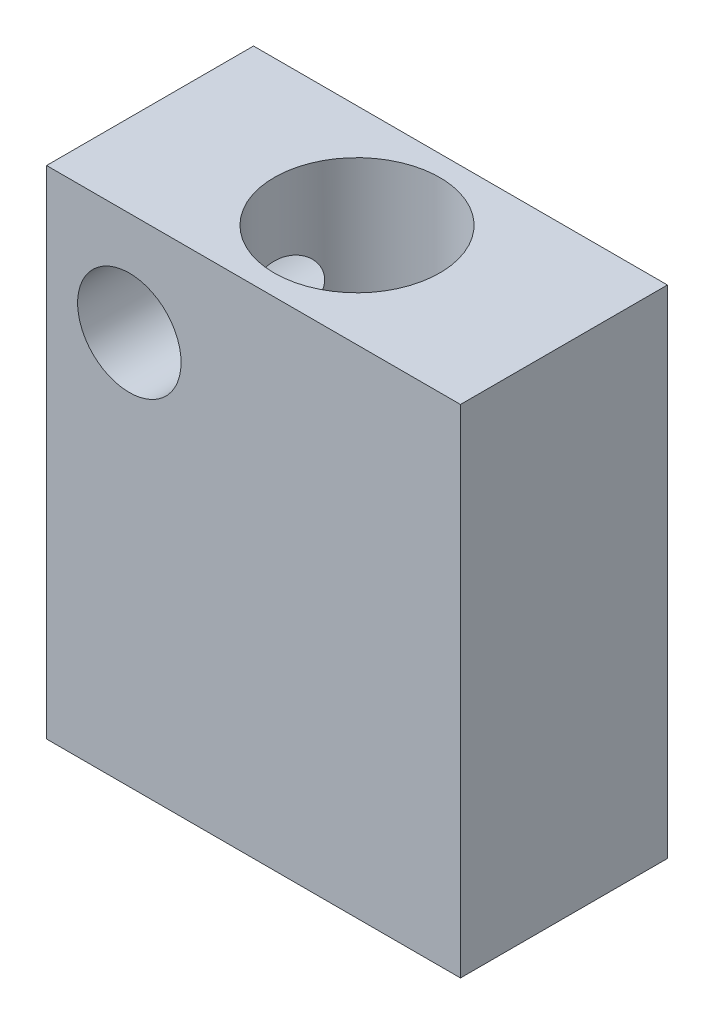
ISO-10303-21;
HEADER;
FILE_DESCRIPTION(('STEP AP214'),'2;1');
FILE_NAME('part.step','',(''),(''),'','','');
FILE_SCHEMA(('AUTOMOTIVE_DESIGN { 1 0 10303 214 1 1 1 1 }'));
ENDSEC;
DATA;
#1=APPLICATION_CONTEXT('core data for automotive mechanical design processes');
#2=APPLICATION_PROTOCOL_DEFINITION('international standard','automotive_design',2000,#1);
#3=PRODUCT_CONTEXT('',#1,'mechanical');
#4=PRODUCT('Part','Part','',(#3));
#5=PRODUCT_RELATED_PRODUCT_CATEGORY('part','',(#4));
#6=PRODUCT_DEFINITION_FORMATION('','',#4);
#7=PRODUCT_DEFINITION_CONTEXT('part definition',#1,'design');
#8=PRODUCT_DEFINITION('design','',#6,#7);
#9=PRODUCT_DEFINITION_SHAPE('','',#8);
#10=(LENGTH_UNIT() NAMED_UNIT(*) SI_UNIT(.MILLI.,.METRE.));
#11=(NAMED_UNIT(*) PLANE_ANGLE_UNIT() SI_UNIT($,.RADIAN.));
#12=(NAMED_UNIT(*) SI_UNIT($,.STERADIAN.) SOLID_ANGLE_UNIT());
#13=UNCERTAINTY_MEASURE_WITH_UNIT(LENGTH_MEASURE(1.E-05),#10,'distance_accuracy_value','');
#14=(GEOMETRIC_REPRESENTATION_CONTEXT(3) GLOBAL_UNCERTAINTY_ASSIGNED_CONTEXT((#13)) GLOBAL_UNIT_ASSIGNED_CONTEXT((#10,
#11,#12)) REPRESENTATION_CONTEXT('',''));
#15=CARTESIAN_POINT('',(0.,0.,0.));
#16=DIRECTION('',(0.,0.,1.));
#17=DIRECTION('',(1.,0.,0.));
#18=AXIS2_PLACEMENT_3D('',#15,#16,#17);
#19=CARTESIAN_POINT('',(50.,-120.,25.));
#20=DIRECTION('',(1.,0.,0.));
#21=DIRECTION('',(0.,0.,-1.));
#22=AXIS2_PLACEMENT_3D('',#19,#20,#21);
#23=PLANE('',#22);
#24=DIRECTION('',(0.,0.,-1.));
#25=VECTOR('',#24,1.);
#26=CARTESIAN_POINT('',(50.,0.,25.));
#27=LINE('',#26,#25);
#28=CARTESIAN_POINT('',(50.,0.,25.));
#29=VERTEX_POINT('',#28);
#30=CARTESIAN_POINT('',(50.,0.,-25.));
#31=VERTEX_POINT('',#30);
#32=EDGE_CURVE('E104',#29,#31,#27,.T.);
#33=ORIENTED_EDGE('',*,*,#32,.F.);
#34=DIRECTION('',(0.,1.,0.));
#35=VECTOR('',#34,1.);
#36=CARTESIAN_POINT('',(50.,-120.,25.));
#37=LINE('',#36,#35);
#38=CARTESIAN_POINT('',(50.,-120.,25.));
#39=VERTEX_POINT('',#38);
#40=EDGE_CURVE('E11',#39,#29,#37,.T.);
#41=ORIENTED_EDGE('',*,*,#40,.F.);
#42=DIRECTION('',(0.,0.,-1.));
#43=VECTOR('',#42,1.);
#44=CARTESIAN_POINT('',(50.,-120.,25.));
#45=LINE('',#44,#43);
#46=CARTESIAN_POINT('',(50.,-120.,-25.));
#47=VERTEX_POINT('',#46);
#48=EDGE_CURVE('E97',#39,#47,#45,.T.);
#49=ORIENTED_EDGE('',*,*,#48,.T.);
#50=DIRECTION('',(0.,1.,0.));
#51=VECTOR('',#50,1.);
#52=CARTESIAN_POINT('',(50.,-120.,-25.));
#53=LINE('',#52,#51);
#54=EDGE_CURVE('E80',#47,#31,#53,.T.);
#55=ORIENTED_EDGE('',*,*,#54,.T.);
#56=EDGE_LOOP('',(#33,#41,#49,#55));
#57=FACE_BOUND('',#56,.T.);
#58=ADVANCED_FACE('F33',(#57),#23,.T.);
#59=CARTESIAN_POINT('',(-50.,-120.,25.));
#60=DIRECTION('',(0.,0.,1.));
#61=DIRECTION('',(1.,0.,0.));
#62=AXIS2_PLACEMENT_3D('',#59,#60,#61);
#63=PLANE('',#62);
#64=CARTESIAN_POINT('',(-30.,-25.,25.));
#65=DIRECTION('',(0.,0.,1.));
#66=DIRECTION('',(1.,0.,0.));
#67=AXIS2_PLACEMENT_3D('',#64,#65,#66);
#68=CIRCLE('',#67,12.5);
#69=CARTESIAN_POINT('',(-17.5,-25.,25.));
#70=VERTEX_POINT('',#69);
#71=EDGE_CURVE('E137',#70,#70,#68,.T.);
#72=ORIENTED_EDGE('',*,*,#71,.F.);
#73=EDGE_LOOP('',(#72));
#74=FACE_BOUND('',#73,.T.);
#75=DIRECTION('',(1.,0.,0.));
#76=VECTOR('',#75,1.);
#77=CARTESIAN_POINT('',(-50.,0.,25.));
#78=LINE('',#77,#76);
#79=CARTESIAN_POINT('',(-50.,0.,25.));
#80=VERTEX_POINT('',#79);
#81=EDGE_CURVE('E99',#80,#29,#78,.T.);
#82=ORIENTED_EDGE('',*,*,#81,.F.);
#83=DIRECTION('',(0.,1.,0.));
#84=VECTOR('',#83,1.);
#85=CARTESIAN_POINT('',(-50.,-120.,25.));
#86=LINE('',#85,#84);
#87=CARTESIAN_POINT('',(-50.,-120.,25.));
#88=VERTEX_POINT('',#87);
#89=EDGE_CURVE('E46',#88,#80,#86,.T.);
#90=ORIENTED_EDGE('',*,*,#89,.F.);
#91=DIRECTION('',(1.,0.,0.));
#92=VECTOR('',#91,1.);
#93=CARTESIAN_POINT('',(-50.,-120.,25.));
#94=LINE('',#93,#92);
#95=EDGE_CURVE('E94',#88,#39,#94,.T.);
#96=ORIENTED_EDGE('',*,*,#95,.T.);
#97=ORIENTED_EDGE('',*,*,#40,.T.);
#98=EDGE_LOOP('',(#82,#90,#96,#97));
#99=FACE_BOUND('',#98,.T.);
#100=ADVANCED_FACE('F115',(#74,#99),#63,.T.);
#101=CARTESIAN_POINT('',(-50.,-120.,25.));
#102=DIRECTION('',(-1.,0.,0.));
#103=DIRECTION('',(0.,0.,1.));
#104=AXIS2_PLACEMENT_3D('',#101,#102,#103);
#105=PLANE('',#104);
#106=DIRECTION('',(0.,0.,1.));
#107=VECTOR('',#106,1.);
#108=CARTESIAN_POINT('',(-50.,0.,25.));
#109=LINE('',#108,#107);
#110=CARTESIAN_POINT('',(-50.,0.,-25.));
#111=VERTEX_POINT('',#110);
#112=EDGE_CURVE('E88',#111,#80,#109,.T.);
#113=ORIENTED_EDGE('',*,*,#112,.F.);
#114=DIRECTION('',(0.,1.,0.));
#115=VECTOR('',#114,1.);
#116=CARTESIAN_POINT('',(-50.,-120.,-25.));
#117=LINE('',#116,#115);
#118=CARTESIAN_POINT('',(-50.,-120.,-25.));
#119=VERTEX_POINT('',#118);
#120=EDGE_CURVE('E83',#119,#111,#117,.T.);
#121=ORIENTED_EDGE('',*,*,#120,.F.);
#122=DIRECTION('',(0.,0.,1.));
#123=VECTOR('',#122,1.);
#124=CARTESIAN_POINT('',(-50.,-120.,25.));
#125=LINE('',#124,#123);
#126=EDGE_CURVE('E86',#119,#88,#125,.T.);
#127=ORIENTED_EDGE('',*,*,#126,.T.);
#128=ORIENTED_EDGE('',*,*,#89,.T.);
#129=EDGE_LOOP('',(#113,#121,#127,#128));
#130=FACE_BOUND('',#129,.T.);
#131=ADVANCED_FACE('F85',(#130),#105,.T.);
#132=CARTESIAN_POINT('',(-50.,-120.,-25.));
#133=DIRECTION('',(0.,0.,-1.));
#134=DIRECTION('',(-1.,0.,0.));
#135=AXIS2_PLACEMENT_3D('',#132,#133,#134);
#136=PLANE('',#135);
#137=CARTESIAN_POINT('',(-30.,-25.,-25.));
#138=DIRECTION('',(0.,0.,1.));
#139=DIRECTION('',(1.,0.,0.));
#140=AXIS2_PLACEMENT_3D('',#137,#138,#139);
#141=CIRCLE('',#140,12.5);
#142=CARTESIAN_POINT('',(-17.5,-25.,-25.));
#143=VERTEX_POINT('',#142);
#144=EDGE_CURVE('E135',#143,#143,#141,.T.);
#145=ORIENTED_EDGE('',*,*,#144,.T.);
#146=EDGE_LOOP('',(#145));
#147=FACE_BOUND('',#146,.T.);
#148=DIRECTION('',(-1.,0.,0.));
#149=VECTOR('',#148,1.);
#150=CARTESIAN_POINT('',(-50.,0.,-25.));
#151=LINE('',#150,#149);
#152=EDGE_CURVE('E107',#31,#111,#151,.T.);
#153=ORIENTED_EDGE('',*,*,#152,.F.);
#154=ORIENTED_EDGE('',*,*,#54,.F.);
#155=DIRECTION('',(-1.,0.,0.));
#156=VECTOR('',#155,1.);
#157=CARTESIAN_POINT('',(-50.,-120.,-25.));
#158=LINE('',#157,#156);
#159=EDGE_CURVE('E93',#47,#119,#158,.T.);
#160=ORIENTED_EDGE('',*,*,#159,.T.);
#161=ORIENTED_EDGE('',*,*,#120,.T.);
#162=EDGE_LOOP('',(#153,#154,#160,#161));
#163=FACE_BOUND('',#162,.T.);
#164=ADVANCED_FACE('F96',(#147,#163),#136,.T.);
#165=CARTESIAN_POINT('',(0.,-120.,0.));
#166=DIRECTION('',(0.,-1.,0.));
#167=DIRECTION('',(0.,0.,-1.));
#168=AXIS2_PLACEMENT_3D('',#165,#166,#167);
#169=PLANE('',#168);
#170=CARTESIAN_POINT('',(0.,-120.,0.));
#171=DIRECTION('',(0.,1.,0.));
#172=DIRECTION('',(0.,0.,1.));
#173=AXIS2_PLACEMENT_3D('',#170,#171,#172);
#174=CIRCLE('',#173,20.);
#175=CARTESIAN_POINT('',(0.,-120.,20.));
#176=VERTEX_POINT('',#175);
#177=EDGE_CURVE('E108',#176,#176,#174,.T.);
#178=ORIENTED_EDGE('',*,*,#177,.T.);
#179=EDGE_LOOP('',(#178));
#180=FACE_BOUND('',#179,.T.);
#181=ORIENTED_EDGE('',*,*,#48,.F.);
#182=ORIENTED_EDGE('',*,*,#95,.F.);
#183=ORIENTED_EDGE('',*,*,#126,.F.);
#184=ORIENTED_EDGE('',*,*,#159,.F.);
#185=EDGE_LOOP('',(#181,#182,#183,#184));
#186=FACE_BOUND('',#185,.T.);
#187=ADVANCED_FACE('F92',(#180,#186),#169,.T.);
#188=CARTESIAN_POINT('',(0.,0.,0.));
#189=DIRECTION('',(0.,-1.,0.));
#190=DIRECTION('',(0.,0.,-1.));
#191=AXIS2_PLACEMENT_3D('',#188,#189,#190);
#192=PLANE('',#191);
#193=CARTESIAN_POINT('',(0.,0.,0.));
#194=DIRECTION('',(0.,1.,0.));
#195=DIRECTION('',(0.,0.,1.));
#196=AXIS2_PLACEMENT_3D('',#193,#194,#195);
#197=CIRCLE('',#196,20.);
#198=CARTESIAN_POINT('',(0.,0.,20.));
#199=VERTEX_POINT('',#198);
#200=EDGE_CURVE('E140',#199,#199,#197,.T.);
#201=ORIENTED_EDGE('',*,*,#200,.F.);
#202=EDGE_LOOP('',(#201));
#203=FACE_BOUND('',#202,.T.);
#204=ORIENTED_EDGE('',*,*,#32,.T.);
#205=ORIENTED_EDGE('',*,*,#152,.T.);
#206=ORIENTED_EDGE('',*,*,#112,.T.);
#207=ORIENTED_EDGE('',*,*,#81,.T.);
#208=EDGE_LOOP('',(#204,#205,#206,#207));
#209=FACE_BOUND('',#208,.T.);
#210=ADVANCED_FACE('F114',(#203,#209),#192,.F.);
#211=CARTESIAN_POINT('',(0.,-120.,0.));
#212=DIRECTION('',(0.,1.,0.));
#213=DIRECTION('',(0.,0.,1.));
#214=AXIS2_PLACEMENT_3D('',#211,#212,#213);
#215=CYLINDRICAL_SURFACE('',#214,20.);
#216=CARTESIAN_POINT('',(-17.5,-25.,-9.68245836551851));
#217=CARTESIAN_POINT('',(-17.5000016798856,-25.1959856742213,-9.68245689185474));
#218=CARTESIAN_POINT('',(-17.5046241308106,-25.3920604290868,-9.6741152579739));
#219=CARTESIAN_POINT('',(-17.5229816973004,-25.7824732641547,-9.64082274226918));
#220=CARTESIAN_POINT('',(-17.5367241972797,-25.9768098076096,-9.6158584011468));
#221=CARTESIAN_POINT('',(-17.5729548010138,-26.3624038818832,-9.54948638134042));
#222=CARTESIAN_POINT('',(-17.5954676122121,-26.5536511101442,-9.50803224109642));
#223=CARTESIAN_POINT('',(-17.6485462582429,-26.9307643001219,-9.40914213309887));
#224=CARTESIAN_POINT('',(-17.6791104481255,-27.1166313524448,-9.35170942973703));
#225=CARTESIAN_POINT('',(-17.7472127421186,-27.4805861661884,-9.22181003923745));
#226=CARTESIAN_POINT('',(-17.7847140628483,-27.6587091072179,-9.14942242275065));
#227=CARTESIAN_POINT('',(-17.8657373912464,-28.0069316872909,-8.99018372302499));
#228=CARTESIAN_POINT('',(-17.9092597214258,-28.1770308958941,-8.90333186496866));
#229=CARTESIAN_POINT('',(-18.0011179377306,-28.5080342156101,-8.71611127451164));
#230=CARTESIAN_POINT('',(-18.0494495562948,-28.668946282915,-8.61575449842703));
#231=CARTESIAN_POINT('',(-18.1497469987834,-28.9810050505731,-8.40241722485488));
#232=CARTESIAN_POINT('',(-18.2017142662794,-29.1321478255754,-8.28943170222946));
#233=CARTESIAN_POINT('',(-18.3577941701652,-29.5606287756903,-7.9406917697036));
#234=CARTESIAN_POINT('',(-18.4652498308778,-29.8238900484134,-7.68888746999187));
#235=CARTESIAN_POINT('',(-18.6807523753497,-30.309953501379,-7.14939140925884));
#236=CARTESIAN_POINT('',(-18.7887994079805,-30.5327449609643,-6.86169017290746));
#237=CARTESIAN_POINT('',(-18.9553640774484,-30.8552592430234,-6.38199084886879));
#238=CARTESIAN_POINT('',(-19.0159914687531,-30.9679361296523,-6.19924111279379));
#239=CARTESIAN_POINT('',(-19.1339053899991,-31.180026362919,-5.82512455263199));
#240=CARTESIAN_POINT('',(-19.1911916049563,-31.2794384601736,-5.63375691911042));
#241=CARTESIAN_POINT('',(-19.3014448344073,-31.4654943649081,-5.24360213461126));
#242=CARTESIAN_POINT('',(-19.3544094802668,-31.5521311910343,-5.04481100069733));
#243=CARTESIAN_POINT('',(-19.4551827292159,-31.7131097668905,-4.64103189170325));
#244=CARTESIAN_POINT('',(-19.5029907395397,-31.7874501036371,-4.43604320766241));
#245=CARTESIAN_POINT('',(-19.6022839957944,-31.9388299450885,-3.97701173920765));
#246=CARTESIAN_POINT('',(-19.6524086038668,-32.0131152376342,-3.72176319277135));
#247=CARTESIAN_POINT('',(-19.7432058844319,-32.1452496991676,-3.20539777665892));
#248=CARTESIAN_POINT('',(-19.783877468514,-32.203096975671,-2.94428023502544));
#249=CARTESIAN_POINT('',(-19.8551256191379,-32.303101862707,-2.41756965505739));
#250=CARTESIAN_POINT('',(-19.8856971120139,-32.3452515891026,-2.15197443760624));
#251=CARTESIAN_POINT('',(-19.9362643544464,-32.4143812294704,-1.61782462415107));
#252=CARTESIAN_POINT('',(-19.9562595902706,-32.4413604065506,-1.34926988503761));
#253=CARTESIAN_POINT('',(-19.9879736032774,-32.4839954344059,-0.76272155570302));
#254=CARTESIAN_POINT('',(-19.9975972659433,-32.4967967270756,-0.444401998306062));
#255=CARTESIAN_POINT('',(-20.0016097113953,-32.5021458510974,0.192526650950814));
#256=CARTESIAN_POINT('',(-19.9959967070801,-32.4946913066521,0.511135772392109));
#257=CARTESIAN_POINT('',(-19.9696212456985,-32.4593561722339,1.14699020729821));
#258=CARTESIAN_POINT('',(-19.9488404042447,-32.4314507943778,1.46423339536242));
#259=CARTESIAN_POINT('',(-19.8925065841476,-32.3546477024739,2.09484937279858));
#260=CARTESIAN_POINT('',(-19.856953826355,-32.3057503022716,2.4082222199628));
#261=CARTESIAN_POINT('',(-19.7696165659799,-32.1829826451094,3.04477447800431));
#262=CARTESIAN_POINT('',(-19.7170931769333,-32.1079603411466,3.36763268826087));
#263=CARTESIAN_POINT('',(-19.597831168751,-31.9322549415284,4.00371207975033));
#264=CARTESIAN_POINT('',(-19.5310899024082,-31.8315670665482,4.31693145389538));
#265=CARTESIAN_POINT('',(-19.385504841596,-31.6030904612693,4.92961676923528));
#266=CARTESIAN_POINT('',(-19.3066886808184,-31.4753633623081,5.22911213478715));
#267=CARTESIAN_POINT('',(-19.1395407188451,-31.1909294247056,5.81115258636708));
#268=CARTESIAN_POINT('',(-19.051214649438,-31.0342400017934,6.09370772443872));
#269=CARTESIAN_POINT('',(-18.9003455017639,-30.7501104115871,6.54309784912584));
#270=CARTESIAN_POINT('',(-18.8394933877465,-30.631392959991,6.71606009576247));
#271=CARTESIAN_POINT('',(-18.7164907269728,-30.3806981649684,7.05158520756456));
#272=CARTESIAN_POINT('',(-18.6543405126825,-30.2487241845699,7.21415069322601));
#273=CARTESIAN_POINT('',(-18.5301359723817,-29.9714463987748,7.52744720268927));
#274=CARTESIAN_POINT('',(-18.4680816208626,-29.8261471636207,7.67818225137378));
#275=CARTESIAN_POINT('',(-18.3455805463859,-29.5223146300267,7.96644231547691));
#276=CARTESIAN_POINT('',(-18.2851338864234,-29.3637808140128,8.1039668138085));
#277=CARTESIAN_POINT('',(-18.1669789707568,-29.0324691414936,8.36550403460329));
#278=CARTESIAN_POINT('',(-18.1092997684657,-28.8595773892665,8.48938605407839));
#279=CARTESIAN_POINT('',(-17.9990187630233,-28.501642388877,8.72076597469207));
#280=CARTESIAN_POINT('',(-17.9464162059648,-28.3166009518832,8.82826630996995));
#281=CARTESIAN_POINT('',(-17.8480246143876,-27.9356710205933,9.02552898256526));
#282=CARTESIAN_POINT('',(-17.8022322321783,-27.7397879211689,9.11530004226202));
#283=CARTESIAN_POINT('',(-17.7190301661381,-27.338736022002,9.27600001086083));
#284=CARTESIAN_POINT('',(-17.681618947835,-27.1335689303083,9.34693236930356));
#285=CARTESIAN_POINT('',(-17.6211501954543,-26.7455646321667,9.46036911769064));
#286=CARTESIAN_POINT('',(-17.5968097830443,-26.5636841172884,9.50547781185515));
#287=CARTESIAN_POINT('',(-17.5559731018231,-26.1959900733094,9.58069140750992));
#288=CARTESIAN_POINT('',(-17.5394758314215,-26.0101770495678,9.61079822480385));
#289=CARTESIAN_POINT('',(-17.5147973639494,-25.6362476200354,9.65569940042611));
#290=CARTESIAN_POINT('',(-17.5066124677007,-25.4481322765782,9.67050057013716));
#291=CARTESIAN_POINT('',(-17.4987811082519,-25.0711457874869,9.68466464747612));
#292=CARTESIAN_POINT('',(-17.4991342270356,-24.8822746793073,9.68402831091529));
#293=CARTESIAN_POINT('',(-17.5079532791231,-24.5222387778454,9.66807305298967));
#294=CARTESIAN_POINT('',(-17.5156934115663,-24.3509960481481,9.65406766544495));
#295=CARTESIAN_POINT('',(-17.5380633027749,-24.0104234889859,9.61336963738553));
#296=CARTESIAN_POINT('',(-17.5526952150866,-23.8410942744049,9.58667303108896));
#297=CARTESIAN_POINT('',(-17.5884957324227,-23.5056789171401,9.520830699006));
#298=CARTESIAN_POINT('',(-17.6096607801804,-23.3395910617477,9.48169174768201));
#299=CARTESIAN_POINT('',(-17.6580489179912,-23.0115986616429,9.39126913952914));
#300=CARTESIAN_POINT('',(-17.685274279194,-22.8496957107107,9.33998092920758));
#301=CARTESIAN_POINT('',(-17.7453488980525,-22.5301610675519,9.22533461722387));
#302=CARTESIAN_POINT('',(-17.7782310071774,-22.3725609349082,9.16190575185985));
#303=CARTESIAN_POINT('',(-17.8487788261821,-22.0635060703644,9.02369762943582));
#304=CARTESIAN_POINT('',(-17.8864462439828,-21.9120535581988,8.94891431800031));
#305=CARTESIAN_POINT('',(-18.0054330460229,-21.4681485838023,8.70840564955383));
#306=CARTESIAN_POINT('',(-18.0927823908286,-21.1859165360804,8.52643754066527));
#307=CARTESIAN_POINT('',(-18.2846077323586,-20.6303835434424,8.10743842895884));
#308=CARTESIAN_POINT('',(-18.3899116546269,-20.3599680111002,7.86700555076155));
#309=CARTESIAN_POINT('',(-18.6030294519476,-19.8586598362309,7.34885157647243));
#310=CARTESIAN_POINT('',(-18.7108445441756,-19.6277868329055,7.0711120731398));
#311=CARTESIAN_POINT('',(-18.8774651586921,-19.2940390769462,6.60864148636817));
#312=CARTESIAN_POINT('',(-18.9378763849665,-19.1780672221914,6.43370408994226));
#313=CARTESIAN_POINT('',(-19.0559662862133,-18.9590056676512,6.07500963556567));
#314=CARTESIAN_POINT('',(-19.1136447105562,-18.8559171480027,5.89125177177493));
#315=CARTESIAN_POINT('',(-19.225266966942,-18.6622058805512,5.51610775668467));
#316=CARTESIAN_POINT('',(-19.2792091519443,-18.5715886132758,5.32471829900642));
#317=CARTESIAN_POINT('',(-19.3825063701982,-18.4023753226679,4.93548408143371));
#318=CARTESIAN_POINT('',(-19.4318608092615,-18.3237808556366,4.73763848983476));
#319=CARTESIAN_POINT('',(-19.5351159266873,-18.1628083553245,4.29433741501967));
#320=CARTESIAN_POINT('',(-19.5877897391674,-18.0831109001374,4.04761991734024));
#321=CARTESIAN_POINT('',(-19.6844412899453,-17.939779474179,3.54789652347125));
#322=CARTESIAN_POINT('',(-19.7284180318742,-17.8761473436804,3.29488991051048));
#323=CARTESIAN_POINT('',(-19.8069795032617,-17.7641853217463,2.78395387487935));
#324=CARTESIAN_POINT('',(-19.8415595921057,-17.7158629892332,2.5260220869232));
#325=CARTESIAN_POINT('',(-19.9007910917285,-17.6339614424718,2.00669918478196));
#326=CARTESIAN_POINT('',(-19.9254417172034,-17.6003833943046,1.74530779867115));
#327=CARTESIAN_POINT('',(-19.9681067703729,-17.5426096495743,1.17139916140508));
#328=CARTESIAN_POINT('',(-19.9840297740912,-17.5213266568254,0.85842809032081));
#329=CARTESIAN_POINT('',(-20.0011223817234,-17.4984909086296,0.231345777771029));
#330=CARTESIAN_POINT('',(-20.0022902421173,-17.4969404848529,-0.0827655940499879));
#331=CARTESIAN_POINT('',(-19.9898421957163,-17.5135553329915,-0.710545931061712));
#332=CARTESIAN_POINT('',(-19.9762091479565,-17.5317434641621,-1.02421396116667));
#333=CARTESIAN_POINT('',(-19.9343809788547,-17.5882158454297,-1.64876110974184));
#334=CARTESIAN_POINT('',(-19.9061859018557,-17.626500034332,-1.95964023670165));
#335=CARTESIAN_POINT('',(-19.8333268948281,-17.7272485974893,-2.59794469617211));
#336=CARTESIAN_POINT('',(-19.7876565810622,-17.7912055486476,-2.92502263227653));
#337=CARTESIAN_POINT('',(-19.6813594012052,-17.9441985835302,-3.57088203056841));
#338=CARTESIAN_POINT('',(-19.620729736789,-18.0332393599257,-3.8896619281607));
#339=CARTESIAN_POINT('',(-19.4862936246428,-18.2378303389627,-4.5151417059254));
#340=CARTESIAN_POINT('',(-19.4125101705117,-18.3533343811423,-4.82186154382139));
#341=CARTESIAN_POINT('',(-19.254049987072,-18.6126967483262,-5.42006824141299));
#342=CARTESIAN_POINT('',(-19.169379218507,-18.7565395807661,-5.71156331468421));
#343=CARTESIAN_POINT('',(-19.0214059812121,-19.022095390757,-6.18268725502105));
#344=CARTESIAN_POINT('',(-18.9602054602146,-19.1355885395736,-6.36764447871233));
#345=CARTESIAN_POINT('',(-18.8355532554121,-19.3765191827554,-6.72741654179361));
#346=CARTESIAN_POINT('',(-18.7721021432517,-19.5039531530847,-6.90223392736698));
#347=CARTESIAN_POINT('',(-18.6444113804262,-19.7728878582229,-7.24006135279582));
#348=CARTESIAN_POINT('',(-18.5801727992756,-19.9143710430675,-7.40308569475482));
#349=CARTESIAN_POINT('',(-18.4524506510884,-20.2114396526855,-7.71593544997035));
#350=CARTESIAN_POINT('',(-18.3889669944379,-20.3670233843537,-7.86576244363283));
#351=CARTESIAN_POINT('',(-18.2208006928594,-20.8062223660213,-8.25058262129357));
#352=CARTESIAN_POINT('',(-18.1183771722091,-21.1032397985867,-8.47179932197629));
#353=CARTESIAN_POINT('',(-17.9770549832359,-21.57567545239,-8.76569770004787));
#354=CARTESIAN_POINT('',(-17.9319731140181,-21.7377592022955,-8.8573925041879));
#355=CARTESIAN_POINT('',(-17.8469960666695,-22.0701760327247,-9.02738773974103));
#356=CARTESIAN_POINT('',(-17.807100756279,-22.24050890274,-9.10568851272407));
#357=CARTESIAN_POINT('',(-17.7333396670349,-22.5893898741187,-9.24852340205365));
#358=CARTESIAN_POINT('',(-17.6995127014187,-22.7679822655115,-9.31296938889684));
#359=CARTESIAN_POINT('',(-17.6391334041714,-23.1310880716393,-9.4268302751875));
#360=CARTESIAN_POINT('',(-17.6125803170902,-23.3156008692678,-9.4762467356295));
#361=CARTESIAN_POINT('',(-17.5675683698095,-23.6885718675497,-9.55943392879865));
#362=CARTESIAN_POINT('',(-17.5490886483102,-23.8770185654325,-9.59324499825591));
#363=CARTESIAN_POINT('',(-17.5206754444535,-24.2566112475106,-9.64504095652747));
#364=CARTESIAN_POINT('',(-17.5107353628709,-24.447755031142,-9.66303806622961));
#365=CARTESIAN_POINT('',(-17.5034700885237,-24.6994009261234,-9.67618412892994));
#366=CARTESIAN_POINT('',(-17.5021695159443,-24.759485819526,-9.67853633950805));
#367=CARTESIAN_POINT('',(-17.5004341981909,-24.8797110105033,-9.68167371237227));
#368=CARTESIAN_POINT('',(-17.4999994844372,-24.9398513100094,-9.68245881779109));
#369=CARTESIAN_POINT('',(-17.5,-25.,-9.68245836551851));
#370=B_SPLINE_CURVE_WITH_KNOTS('',3,(#216,#217,#218,#219,#220,#221,#222,#223,#224,#225,#226,
#227,#228,#229,#230,#231,#232,#233,#234,#235,#236,#237,#238,#239,#240,#241,#242,#243,#244,#245,
#246,#247,#248,#249,#250,#251,#252,#253,#254,#255,#256,#257,#258,#259,#260,#261,#262,#263,#264,
#265,#266,#267,#268,#269,#270,#271,#272,#273,#274,#275,#276,#277,#278,#279,#280,#281,#282,#283,
#284,#285,#286,#287,#288,#289,#290,#291,#292,#293,#294,#295,#296,#297,#298,#299,#300,#301,#302,
#303,#304,#305,#306,#307,#308,#309,#310,#311,#312,#313,#314,#315,#316,#317,#318,#319,#320,#321,
#322,#323,#324,#325,#326,#327,#328,#329,#330,#331,#332,#333,#334,#335,#336,#337,#338,#339,#340,
#341,#342,#343,#344,#345,#346,#347,#348,#349,#350,#351,#352,#353,#354,#355,#356,#357,#358,#359,
#360,#361,#362,#363,#364,#365,#366,#367,#368,#369),.UNSPECIFIED.,.T.,.F.,(4,2,2,2,2,2,2,2,2,2,2,
2,2,2,2,2,2,2,2,2,2,2,2,2,2,2,2,2,2,2,2,2,2,2,2,2,2,2,2,2,2,2,2,2,2,2,2,2,2,2,2,2,2,2,2,2,2,2,2,
2,2,2,2,2,2,2,2,2,2,2,2,2,2,2,2,2,4),(0.,0.587880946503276,1.17623847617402,1.76626563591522,
2.35617234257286,2.94303640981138,3.52993192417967,4.11631121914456,4.70292467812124,
5.83778467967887,6.97294487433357,7.64168677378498,8.31049161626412,8.97966059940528,
9.64890642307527,10.4596901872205,11.270567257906,12.0818510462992,12.893174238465,
13.8482997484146,14.8035372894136,15.7599345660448,16.7163175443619,17.7217448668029,
18.7273595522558,19.7307063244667,20.733451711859,21.3881764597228,22.0427355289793,
22.6970709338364,23.3514319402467,24.0115985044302,24.6716668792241,25.3314097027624,
25.9910316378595,26.5571610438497,27.1232181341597,27.6890232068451,28.2548005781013,
28.770157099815,29.2856747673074,29.8009122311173,30.3163431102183,30.834875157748,
31.3535927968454,32.3902833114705,33.5166680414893,34.643610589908,35.298332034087,
35.9531134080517,36.6081816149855,37.2633345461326,38.0562736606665,38.8493035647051,
39.6427244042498,40.4362079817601,41.3774941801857,42.3188916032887,43.2613804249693,
44.203866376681,45.2117040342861,46.2197303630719,47.226011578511,48.2317441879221,
48.9075514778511,49.5831883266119,50.2579915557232,50.9327138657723,52.0796204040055,
52.6538610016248,53.2280869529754,53.8058640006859,54.3835810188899,54.959796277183,
55.5355658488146,55.7159820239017,55.8964047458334),.UNSPECIFIED.);
#371=CARTESIAN_POINT('',(-17.5,-25.,-9.68245836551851));
#372=VERTEX_POINT('',#371);
#373=EDGE_CURVE('E36',#372,#372,#370,.T.);
#374=ORIENTED_EDGE('',*,*,#373,.T.);
#375=EDGE_LOOP('',(#374));
#376=FACE_BOUND('',#375,.T.);
#377=ORIENTED_EDGE('',*,*,#177,.F.);
#378=EDGE_LOOP('',(#377));
#379=FACE_BOUND('',#378,.T.);
#380=ORIENTED_EDGE('',*,*,#200,.T.);
#381=EDGE_LOOP('',(#380));
#382=FACE_BOUND('',#381,.T.);
#383=ADVANCED_FACE('F148',(#376,#379,#382),#215,.F.);
#384=CARTESIAN_POINT('',(-30.,-25.,-25.));
#385=DIRECTION('',(0.,0.,1.));
#386=DIRECTION('',(1.,0.,0.));
#387=AXIS2_PLACEMENT_3D('',#384,#385,#386);
#388=CYLINDRICAL_SURFACE('',#387,12.5);
#389=ORIENTED_EDGE('',*,*,#71,.T.);
#390=EDGE_LOOP('',(#389));
#391=FACE_BOUND('',#390,.T.);
#392=ORIENTED_EDGE('',*,*,#144,.F.);
#393=EDGE_LOOP('',(#392));
#394=FACE_BOUND('',#393,.T.);
#395=ORIENTED_EDGE('',*,*,#373,.F.);
#396=EDGE_LOOP('',(#395));
#397=FACE_BOUND('',#396,.T.);
#398=ADVANCED_FACE('F154',(#391,#394,#397),#388,.F.);
#399=CLOSED_SHELL('',(#58,#100,#131,#164,#187,#210,#383,#398));
#400=MANIFOLD_SOLID_BREP('B2',#399);
#401=ADVANCED_BREP_SHAPE_REPRESENTATION('',(#18,#400),#14);
#402=SHAPE_DEFINITION_REPRESENTATION(#9,#401);
ENDSEC;
END-ISO-10303-21;
